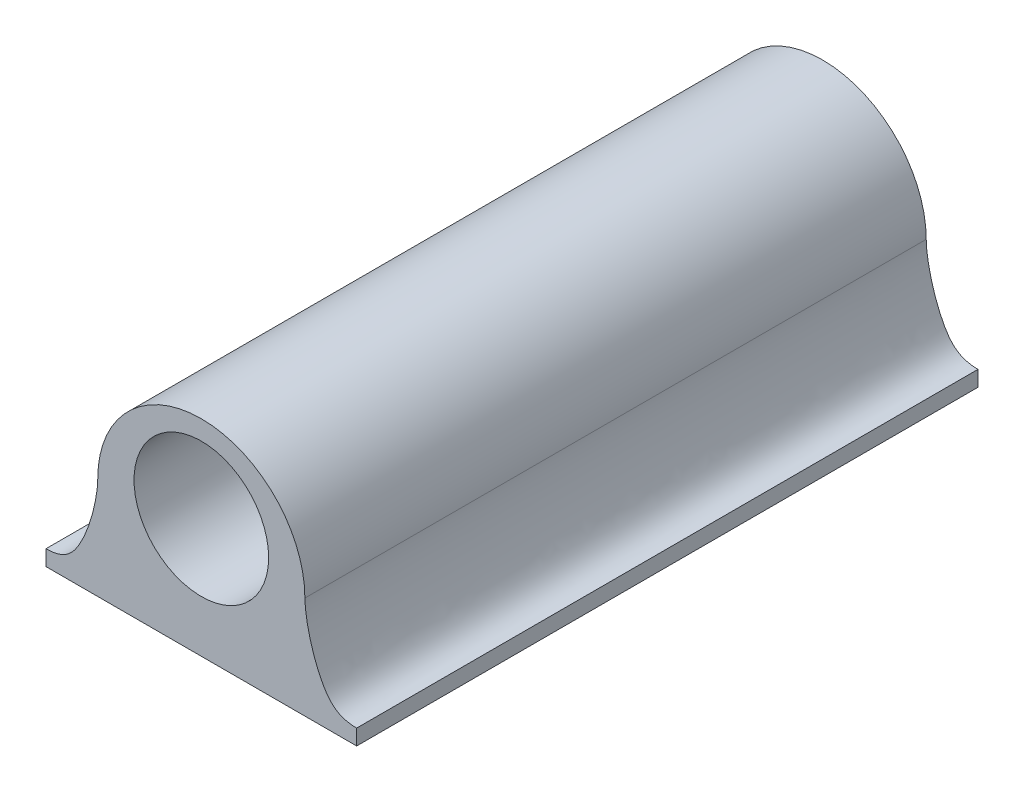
ISO-10303-21;
HEADER;
FILE_DESCRIPTION(('STEP AP214'),'2;1');
FILE_NAME('part.step','',(''),(''),'','','');
FILE_SCHEMA(('AUTOMOTIVE_DESIGN { 1 0 10303 214 1 1 1 1 }'));
ENDSEC;
DATA;
#1=APPLICATION_CONTEXT('core data for automotive mechanical design processes');
#2=APPLICATION_PROTOCOL_DEFINITION('international standard','automotive_design',2000,#1);
#3=PRODUCT_CONTEXT('',#1,'mechanical');
#4=PRODUCT('Part','Part','',(#3));
#5=PRODUCT_RELATED_PRODUCT_CATEGORY('part','',(#4));
#6=PRODUCT_DEFINITION_FORMATION('','',#4);
#7=PRODUCT_DEFINITION_CONTEXT('part definition',#1,'design');
#8=PRODUCT_DEFINITION('design','',#6,#7);
#9=PRODUCT_DEFINITION_SHAPE('','',#8);
#10=(LENGTH_UNIT() NAMED_UNIT(*) SI_UNIT(.MILLI.,.METRE.));
#11=(NAMED_UNIT(*) PLANE_ANGLE_UNIT() SI_UNIT($,.RADIAN.));
#12=(NAMED_UNIT(*) SI_UNIT($,.STERADIAN.) SOLID_ANGLE_UNIT());
#13=UNCERTAINTY_MEASURE_WITH_UNIT(LENGTH_MEASURE(1.E-05),#10,'distance_accuracy_value','');
#14=(GEOMETRIC_REPRESENTATION_CONTEXT(3) GLOBAL_UNCERTAINTY_ASSIGNED_CONTEXT((#13)) GLOBAL_UNIT_ASSIGNED_CONTEXT((#10,
#11,#12)) REPRESENTATION_CONTEXT('',''));
#15=CARTESIAN_POINT('',(0.,0.,0.));
#16=DIRECTION('',(0.,0.,1.));
#17=DIRECTION('',(1.,0.,0.));
#18=AXIS2_PLACEMENT_3D('',#15,#16,#17);
#19=CARTESIAN_POINT('',(15.,-0.75,-30.));
#20=DIRECTION('',(1.,0.,0.));
#21=DIRECTION('',(0.,0.,-1.));
#22=AXIS2_PLACEMENT_3D('',#19,#20,#21);
#23=PLANE('',#22);
#24=DIRECTION('',(0.,0.,1.));
#25=VECTOR('',#24,1.);
#26=CARTESIAN_POINT('',(15.,0.75,-30.));
#27=LINE('',#26,#25);
#28=CARTESIAN_POINT('',(15.,0.75,-30.));
#29=VERTEX_POINT('',#28);
#30=CARTESIAN_POINT('',(15.,0.75,30.));
#31=VERTEX_POINT('',#30);
#32=EDGE_CURVE('E92',#29,#31,#27,.T.);
#33=ORIENTED_EDGE('',*,*,#32,.T.);
#34=DIRECTION('',(0.,1.,0.));
#35=VECTOR('',#34,1.);
#36=CARTESIAN_POINT('',(15.,-0.75,30.));
#37=LINE('',#36,#35);
#38=CARTESIAN_POINT('',(15.,-0.75,30.));
#39=VERTEX_POINT('',#38);
#40=EDGE_CURVE('E154',#39,#31,#37,.T.);
#41=ORIENTED_EDGE('',*,*,#40,.F.);
#42=DIRECTION('',(0.,0.,1.));
#43=VECTOR('',#42,1.);
#44=CARTESIAN_POINT('',(15.,-0.75,-30.));
#45=LINE('',#44,#43);
#46=CARTESIAN_POINT('',(15.,-0.75,-30.));
#47=VERTEX_POINT('',#46);
#48=EDGE_CURVE('E12',#47,#39,#45,.T.);
#49=ORIENTED_EDGE('',*,*,#48,.F.);
#50=DIRECTION('',(0.,1.,0.));
#51=VECTOR('',#50,1.);
#52=CARTESIAN_POINT('',(15.,-0.75,-30.));
#53=LINE('',#52,#51);
#54=EDGE_CURVE('E155',#47,#29,#53,.T.);
#55=ORIENTED_EDGE('',*,*,#54,.T.);
#56=EDGE_LOOP('',(#33,#41,#49,#55));
#57=FACE_BOUND('',#56,.T.);
#58=ADVANCED_FACE('F89',(#57),#23,.T.);
#59=CARTESIAN_POINT('',(-15.,-0.75,-30.));
#60=DIRECTION('',(0.,-1.,0.));
#61=DIRECTION('',(0.,0.,-1.));
#62=AXIS2_PLACEMENT_3D('',#59,#60,#61);
#63=PLANE('',#62);
#64=ORIENTED_EDGE('',*,*,#48,.T.);
#65=DIRECTION('',(1.,0.,0.));
#66=VECTOR('',#65,1.);
#67=CARTESIAN_POINT('',(-15.,-0.75,30.));
#68=LINE('',#67,#66);
#69=CARTESIAN_POINT('',(-15.,-0.75,30.));
#70=VERTEX_POINT('',#69);
#71=EDGE_CURVE('E162',#70,#39,#68,.T.);
#72=ORIENTED_EDGE('',*,*,#71,.F.);
#73=DIRECTION('',(0.,0.,1.));
#74=VECTOR('',#73,1.);
#75=CARTESIAN_POINT('',(-15.,-0.75,-30.));
#76=LINE('',#75,#74);
#77=CARTESIAN_POINT('',(-15.,-0.75,-30.));
#78=VERTEX_POINT('',#77);
#79=EDGE_CURVE('E97',#78,#70,#76,.T.);
#80=ORIENTED_EDGE('',*,*,#79,.F.);
#81=DIRECTION('',(1.,0.,0.));
#82=VECTOR('',#81,1.);
#83=CARTESIAN_POINT('',(-15.,-0.75,-30.));
#84=LINE('',#83,#82);
#85=EDGE_CURVE('E157',#78,#47,#84,.T.);
#86=ORIENTED_EDGE('',*,*,#85,.T.);
#87=EDGE_LOOP('',(#64,#72,#80,#86));
#88=FACE_BOUND('',#87,.T.);
#89=ADVANCED_FACE('F186',(#88),#63,.T.);
#90=CARTESIAN_POINT('',(-15.,-0.75,-30.));
#91=DIRECTION('',(-1.,0.,0.));
#92=DIRECTION('',(0.,0.,1.));
#93=AXIS2_PLACEMENT_3D('',#90,#91,#92);
#94=PLANE('',#93);
#95=ORIENTED_EDGE('',*,*,#79,.T.);
#96=DIRECTION('',(0.,-1.,0.));
#97=VECTOR('',#96,1.);
#98=CARTESIAN_POINT('',(-15.,-0.75,30.));
#99=LINE('',#98,#97);
#100=CARTESIAN_POINT('',(-15.,0.75,30.));
#101=VERTEX_POINT('',#100);
#102=EDGE_CURVE('E163',#101,#70,#99,.T.);
#103=ORIENTED_EDGE('',*,*,#102,.F.);
#104=DIRECTION('',(0.,0.,1.));
#105=VECTOR('',#104,1.);
#106=CARTESIAN_POINT('',(-15.,0.75,-30.));
#107=LINE('',#106,#105);
#108=CARTESIAN_POINT('',(-15.,0.75,-30.));
#109=VERTEX_POINT('',#108);
#110=EDGE_CURVE('E156',#109,#101,#107,.T.);
#111=ORIENTED_EDGE('',*,*,#110,.F.);
#112=DIRECTION('',(0.,-1.,0.));
#113=VECTOR('',#112,1.);
#114=CARTESIAN_POINT('',(-15.,-0.75,-30.));
#115=LINE('',#114,#113);
#116=EDGE_CURVE('E172',#109,#78,#115,.T.);
#117=ORIENTED_EDGE('',*,*,#116,.T.);
#118=EDGE_LOOP('',(#95,#103,#111,#117));
#119=FACE_BOUND('',#118,.T.);
#120=ADVANCED_FACE('F185',(#119),#94,.T.);
#121=CARTESIAN_POINT('',(0.,0.,-30.));
#122=DIRECTION('',(0.,0.,-1.));
#123=DIRECTION('',(-1.,0.,0.));
#124=AXIS2_PLACEMENT_3D('',#121,#122,#123);
#125=PLANE('',#124);
#126=ORIENTED_EDGE('',*,*,#54,.F.);
#127=ORIENTED_EDGE('',*,*,#85,.F.);
#128=ORIENTED_EDGE('',*,*,#116,.F.);
#129=CARTESIAN_POINT('',(-10.,9.12095651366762,-30.));
#130=CARTESIAN_POINT('',(-10.,7.62411142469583,-30.));
#131=CARTESIAN_POINT('',(-11.0113397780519,3.04349833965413,-30.));
#132=CARTESIAN_POINT('',(-13.234776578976,0.75,-30.));
#133=CARTESIAN_POINT('',(-15.,0.75,-30.));
#134=B_SPLINE_CURVE_WITH_KNOTS('',3,(#129,#130,#131,#132,#133),.UNSPECIFIED.,.F.,.F.,(4,1,4),
(0.,0.639512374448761,1.),.UNSPECIFIED.);
#135=CARTESIAN_POINT('',(-10.,9.12095651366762,-30.));
#136=VERTEX_POINT('',#135);
#137=EDGE_CURVE('E182',#136,#109,#134,.T.);
#138=ORIENTED_EDGE('',*,*,#137,.F.);
#139=CARTESIAN_POINT('',(0.,9.12095651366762,-30.));
#140=DIRECTION('',(0.,0.,1.));
#141=DIRECTION('',(1.,0.,0.));
#142=AXIS2_PLACEMENT_3D('',#139,#140,#141);
#143=CIRCLE('',#142,10.);
#144=CARTESIAN_POINT('',(10.,9.12095651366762,-30.));
#145=VERTEX_POINT('',#144);
#146=EDGE_CURVE('E194',#145,#136,#143,.T.);
#147=ORIENTED_EDGE('',*,*,#146,.F.);
#148=CARTESIAN_POINT('',(10.,9.12095651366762,-30.));
#149=CARTESIAN_POINT('',(10.,7.62411142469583,-30.));
#150=CARTESIAN_POINT('',(11.0113397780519,3.04349833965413,-30.));
#151=CARTESIAN_POINT('',(13.234776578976,0.750000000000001,-30.));
#152=CARTESIAN_POINT('',(15.,0.750000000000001,-30.));
#153=B_SPLINE_CURVE_WITH_KNOTS('',3,(#148,#149,#150,#151,#152),.UNSPECIFIED.,.F.,.F.,(4,1,4),
(0.,0.639512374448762,1.),.UNSPECIFIED.);
#154=EDGE_CURVE('E192',#145,#29,#153,.T.);
#155=ORIENTED_EDGE('',*,*,#154,.T.);
#156=EDGE_LOOP('',(#126,#127,#128,#138,#147,#155));
#157=FACE_BOUND('',#156,.T.);
#158=CARTESIAN_POINT('',(0.,10.75,-30.));
#159=DIRECTION('',(0.,0.,1.));
#160=DIRECTION('',(1.,0.,0.));
#161=AXIS2_PLACEMENT_3D('',#158,#159,#160);
#162=CIRCLE('',#161,6.5);
#163=CARTESIAN_POINT('',(6.5,10.75,-30.));
#164=VERTEX_POINT('',#163);
#165=EDGE_CURVE('E195',#164,#164,#162,.T.);
#166=ORIENTED_EDGE('',*,*,#165,.T.);
#167=EDGE_LOOP('',(#166));
#168=FACE_BOUND('',#167,.T.);
#169=ADVANCED_FACE('F189',(#157,#168),#125,.T.);
#170=CARTESIAN_POINT('',(0.,0.,30.));
#171=DIRECTION('',(0.,0.,-1.));
#172=DIRECTION('',(-1.,0.,0.));
#173=AXIS2_PLACEMENT_3D('',#170,#171,#172);
#174=PLANE('',#173);
#175=ORIENTED_EDGE('',*,*,#40,.T.);
#176=CARTESIAN_POINT('',(10.,9.12095651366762,30.));
#177=CARTESIAN_POINT('',(10.,7.62411142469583,30.));
#178=CARTESIAN_POINT('',(11.0113397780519,3.04349833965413,30.));
#179=CARTESIAN_POINT('',(13.234776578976,0.750000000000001,30.));
#180=CARTESIAN_POINT('',(15.,0.750000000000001,30.));
#181=B_SPLINE_CURVE_WITH_KNOTS('',3,(#176,#177,#178,#179,#180),.UNSPECIFIED.,.F.,.F.,(4,1,4),
(0.,0.639512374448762,1.),.UNSPECIFIED.);
#182=CARTESIAN_POINT('',(10.,9.12095651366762,30.));
#183=VERTEX_POINT('',#182);
#184=EDGE_CURVE('E142',#183,#31,#181,.T.);
#185=ORIENTED_EDGE('',*,*,#184,.F.);
#186=CARTESIAN_POINT('',(0.,9.12095651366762,30.));
#187=DIRECTION('',(0.,0.,1.));
#188=DIRECTION('',(1.,0.,0.));
#189=AXIS2_PLACEMENT_3D('',#186,#187,#188);
#190=CIRCLE('',#189,10.);
#191=CARTESIAN_POINT('',(-10.,9.12095651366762,30.));
#192=VERTEX_POINT('',#191);
#193=EDGE_CURVE('E199',#183,#192,#190,.T.);
#194=ORIENTED_EDGE('',*,*,#193,.T.);
#195=CARTESIAN_POINT('',(-10.,9.12095651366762,30.));
#196=CARTESIAN_POINT('',(-10.,7.62411142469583,30.));
#197=CARTESIAN_POINT('',(-11.0113397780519,3.04349833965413,30.));
#198=CARTESIAN_POINT('',(-13.234776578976,0.75,30.));
#199=CARTESIAN_POINT('',(-15.,0.75,30.));
#200=B_SPLINE_CURVE_WITH_KNOTS('',3,(#195,#196,#197,#198,#199),.UNSPECIFIED.,.F.,.F.,(4,1,4),
(0.,0.639512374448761,1.),.UNSPECIFIED.);
#201=EDGE_CURVE('E151',#192,#101,#200,.T.);
#202=ORIENTED_EDGE('',*,*,#201,.T.);
#203=ORIENTED_EDGE('',*,*,#102,.T.);
#204=ORIENTED_EDGE('',*,*,#71,.T.);
#205=EDGE_LOOP('',(#175,#185,#194,#202,#203,#204));
#206=FACE_BOUND('',#205,.T.);
#207=CARTESIAN_POINT('',(0.,10.75,30.));
#208=DIRECTION('',(0.,0.,1.));
#209=DIRECTION('',(1.,0.,0.));
#210=AXIS2_PLACEMENT_3D('',#207,#208,#209);
#211=CIRCLE('',#210,6.5);
#212=CARTESIAN_POINT('',(6.5,10.75,30.));
#213=VERTEX_POINT('',#212);
#214=EDGE_CURVE('E152',#213,#213,#211,.T.);
#215=ORIENTED_EDGE('',*,*,#214,.F.);
#216=EDGE_LOOP('',(#215));
#217=FACE_BOUND('',#216,.T.);
#218=ADVANCED_FACE('F159',(#206,#217),#174,.F.);
#219=DIRECTION('',(0.,0.,1.));
#220=VECTOR('',#219,1.);
#221=SURFACE_OF_LINEAR_EXTRUSION('',#153,#220);
#222=DIRECTION('',(0.,0.,1.));
#223=VECTOR('',#222,1.);
#224=CARTESIAN_POINT('',(10.,9.12095651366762,-30.));
#225=LINE('',#224,#223);
#226=EDGE_CURVE('E146',#145,#183,#225,.T.);
#227=ORIENTED_EDGE('',*,*,#226,.T.);
#228=ORIENTED_EDGE('',*,*,#184,.T.);
#229=ORIENTED_EDGE('',*,*,#32,.F.);
#230=ORIENTED_EDGE('',*,*,#154,.F.);
#231=EDGE_LOOP('',(#227,#228,#229,#230));
#232=FACE_BOUND('',#231,.T.);
#233=ADVANCED_FACE('F144',(#232),#221,.F.);
#234=DIRECTION('',(0.,0.,1.));
#235=VECTOR('',#234,1.);
#236=SURFACE_OF_LINEAR_EXTRUSION('',#134,#235);
#237=ORIENTED_EDGE('',*,*,#110,.T.);
#238=ORIENTED_EDGE('',*,*,#201,.F.);
#239=DIRECTION('',(0.,0.,1.));
#240=VECTOR('',#239,1.);
#241=CARTESIAN_POINT('',(-10.,9.12095651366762,-30.));
#242=LINE('',#241,#240);
#243=EDGE_CURVE('E164',#136,#192,#242,.T.);
#244=ORIENTED_EDGE('',*,*,#243,.F.);
#245=ORIENTED_EDGE('',*,*,#137,.T.);
#246=EDGE_LOOP('',(#237,#238,#244,#245));
#247=FACE_BOUND('',#246,.T.);
#248=ADVANCED_FACE('F180',(#247),#236,.T.);
#249=CARTESIAN_POINT('',(0.,9.12095651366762,-30.));
#250=DIRECTION('',(0.,0.,1.));
#251=DIRECTION('',(1.,0.,0.));
#252=AXIS2_PLACEMENT_3D('',#249,#250,#251);
#253=CYLINDRICAL_SURFACE('',#252,10.);
#254=ORIENTED_EDGE('',*,*,#243,.T.);
#255=ORIENTED_EDGE('',*,*,#193,.F.);
#256=ORIENTED_EDGE('',*,*,#226,.F.);
#257=ORIENTED_EDGE('',*,*,#146,.T.);
#258=EDGE_LOOP('',(#254,#255,#256,#257));
#259=FACE_BOUND('',#258,.T.);
#260=ADVANCED_FACE('F268',(#259),#253,.T.);
#261=CARTESIAN_POINT('',(0.,10.75,-30.));
#262=DIRECTION('',(0.,0.,1.));
#263=DIRECTION('',(1.,0.,0.));
#264=AXIS2_PLACEMENT_3D('',#261,#262,#263);
#265=CYLINDRICAL_SURFACE('',#264,6.5);
#266=ORIENTED_EDGE('',*,*,#165,.F.);
#267=EDGE_LOOP('',(#266));
#268=FACE_BOUND('',#267,.T.);
#269=ORIENTED_EDGE('',*,*,#214,.T.);
#270=EDGE_LOOP('',(#269));
#271=FACE_BOUND('',#270,.T.);
#272=ADVANCED_FACE('F275',(#268,#271),#265,.F.);
#273=CLOSED_SHELL('',(#58,#89,#120,#169,#218,#233,#248,#260,#272));
#274=MANIFOLD_SOLID_BREP('B2',#273);
#275=ADVANCED_BREP_SHAPE_REPRESENTATION('',(#18,#274),#14);
#276=SHAPE_DEFINITION_REPRESENTATION(#9,#275);
ENDSEC;
END-ISO-10303-21;
